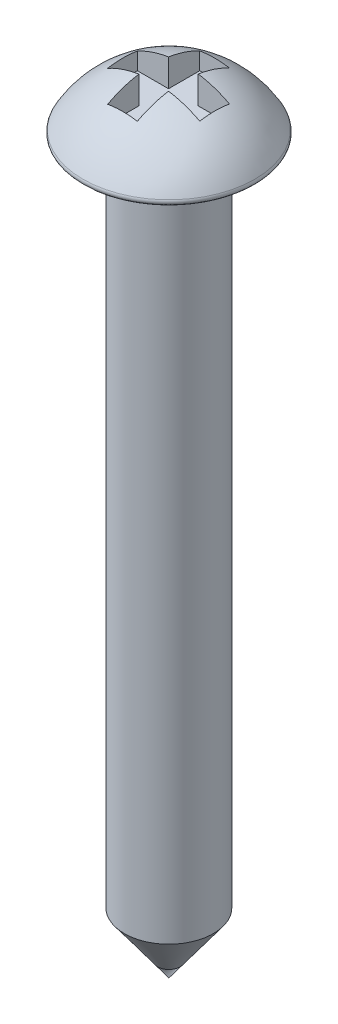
from build123d import *

# Parameters (mm, degrees)
CONG_1_R                = 0.1
ENL_V_MAT_EXTRU_1_DEPTH = 0.5


with BuildPart() as part:
    # Esquisse1 → R_volution1 (revolve)
    with BuildSketch(Plane.XY, mode=Mode.PRIVATE) as r_volution1_sk:
        with BuildLine():
            Line((2.2, 0), (1.1, 0))
            Line((1.1, 0), (1.1, -16.5))
            Line((1.1, -16.5), (0, -18))
            Line((0, -18), (0, 1.392961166))
            ThreePointArc((0, 1.392961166), (1.301954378, 1.015441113), (2.2, 0))
        make_face()
    revolve(r_volution1_sk.sketch.rotate(Axis((0, 3.800054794, 0), (0, -1, 0)), 180), axis=Axis((0, 3.800054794, 0), (0, -1, 0)))

    # Cong_1
    cong_1_edges = [part.edges().sort_by_distance(p)[0] for p in [
        (2.2, 0, 0),
    ]]
    fillet(cong_1_edges, radius=CONG_1_R)

    # Esquisse2 → Enl_v. mat.-Extru.1 (cut, symmetric)
    with BuildSketch(Plane(origin=(0, 1.15653742, 0), x_dir=(-1, 0, 0), z_dir=(0, 1, 0))):
        Polygon((-0.361948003, 1.140760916), (0.37159995, 1.140760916), (0.37159995, 0.37038863), (1.141972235, 0.37038863), (1.141972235, -0.363159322), (0.37159995, -0.363159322), (0.37159995, -1.133531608), (-0.361948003, -1.133531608), (-0.361948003, -0.363159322), (-1.132320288, -0.363159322), (-1.132320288, 0.37038863), (-0.361948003, 0.37038863), align=None)
    extrude(amount=ENL_V_MAT_EXTRU_1_DEPTH, both=True, mode=Mode.SUBTRACT)


solid = part.part
